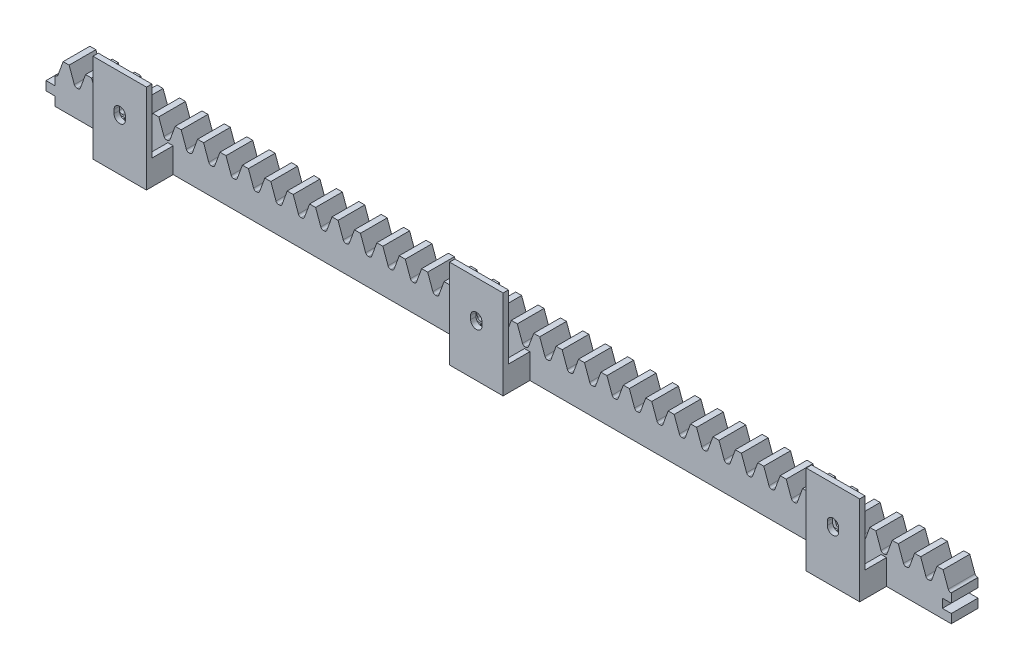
from build123d import *

# Parameters (mm, degrees)
SECTION_CREMAILLERE_W           = 15
SECTION_CREMAILLERE_H           = 27.14159266
BASE_EXTRUSION_DEPTH            = 502.6548256
ENL_V_START                     = -500.969718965
ENL_V_MAT_EXTRU_2_DEPTH         = 600.969718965
R_P_TITION_LIN_AIRE1_COUNT      = 40
R_P_TITION_LIN_AIRE1_PITCH      = 12.56637064
ESQUISSE4_W                     = 3
ESQUISSE4_H                     = 12
BOSS_EXTRU_1_DEPTH              = 14
ESQUISSE5_W                     = 30
ESQUISSE5_H                     = 50
BOSS_EXTRU_2_DEPTH              = 3
ENL_V_MAT_EXTRU_3_DEPTH         = 502.311749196
R_P_TITION_LIN_AIRE2_COUNT      = 2
R_P_TITION_LIN_AIRE2_PITCH      = 200
R_P_TITION_LIN_AIRE2_COUNT_DIR2 = 2
R_P_TITION_LIN_AIRE2_PITCH_DIR2 = 200
ESQUISSE8_W                     = 5
ESQUISSE8_H                     = 5
BOSS_EXTRU_3_DEPTH              = 15
ESQUISSE9_W                     = 5
ESQUISSE9_H                     = 5
ENL_V_MAT_EXTRU_4_DEPTH         = 502.311749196


with BuildPart() as part:
    # Section Cremaillere → Base-Extrusion (new body)
    with BuildSketch(Plane(origin=(-3.14159266, 0, 0), x_dir=(0, 0, -1), z_dir=(1, 0, 0))):
        with Locations((0, -6.42920367)):
            Rectangle(SECTION_CREMAILLERE_W, SECTION_CREMAILLERE_H)
    extrude(amount=BASE_EXTRUSION_DEPTH)

    # Esquisse1 → Enl_v. mat.-Extru.2 (cut)
    with BuildSketch(Plane.XY.offset(ENL_V_START)):
        with BuildLine():
            Line((1.455582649, 4), (-1.45550134, -3.99977656))
            ThreePointArc((-1.45550134, -3.99977656), (-2.011991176, -4.725082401), (-2.883868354, -5))
            Line((-2.883868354, -5), (-3.14159266, -5))
            Line((-3.14159266, -5), (-3.14159266, 7.14159266))
            Line((-3.14159266, 7.14159266), (9.42477798, 7.14159266))
            Line((9.42477798, 7.14159266), (9.42477798, -5))
            Line((9.42477798, -5), (9.167053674, -5))
            ThreePointArc((9.167053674, -5), (8.295176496, -4.725082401), (7.73868666, -3.99977656))
            Line((7.73868666, -3.99977656), (4.827602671, 4))
            Line((4.827602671, 4), (1.455582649, 4))
        make_face()
    enl_v_mat_extru_2 = extrude(amount=ENL_V_MAT_EXTRU_2_DEPTH, mode=Mode.SUBTRACT)

    # R_p_tition lin_aire1: Enl_v. mat.-Extru.2 ×40
    with Locations(*[(i * R_P_TITION_LIN_AIRE1_PITCH, 0, 0) for i in range(1, R_P_TITION_LIN_AIRE1_COUNT)]):
        add(enl_v_mat_extru_2, mode=Mode.SUBTRACT)

    # Esquisse4 → Boss.-Extru.1 (add)
    with BuildSketch(Plane.XZ.offset(20)):
        with Locations((234.68582014, 13.5)):
            Rectangle(ESQUISSE4_W, ESQUISSE4_H)
        with Locations((261.68582014, 13.5)):
            Rectangle(ESQUISSE4_W, ESQUISSE4_H)
    boss_extru_1 = extrude(amount=-BOSS_EXTRU_1_DEPTH)

    # Esquisse5 → Boss.-Extru.2 (add)
    with BuildSketch(Plane.XY.offset(19.5)):
        with Locations((248.18582014, 5)):
            Rectangle(ESQUISSE5_W, ESQUISSE5_H)
    boss_extru_2 = extrude(amount=BOSS_EXTRU_2_DEPTH)

    # Esquisse7 → Enl_v. mat.-Extru.3 (cut, through all)
    with BuildSketch(Plane.XY.offset(22.5)):
        with BuildLine():
            Line((244.98582014, 8), (244.98582014, 10))
            ThreePointArc((244.98582014, 10), (248.18582014, 13.2), (251.38582014, 10))
            Line((251.38582014, 10), (251.38582014, 8))
            ThreePointArc((251.38582014, 8), (248.18582014, 4.8), (244.98582014, 8))
        make_face()
    enl_v_mat_extru_3 = extrude(amount=-ENL_V_MAT_EXTRU_3_DEPTH, mode=Mode.SUBTRACT)

    # R_p_tition lin_aire2: Boss.-Extru.1, Boss.-Extru.2, Enl_v. mat.-Extru.3 2 × 2
    with Locations(*[Vector(1, 0, 0) * (i * R_P_TITION_LIN_AIRE2_PITCH) + Vector(-1, 0, 0) * (j * R_P_TITION_LIN_AIRE2_PITCH_DIR2) for i in range(R_P_TITION_LIN_AIRE2_COUNT) for j in range(R_P_TITION_LIN_AIRE2_COUNT_DIR2) if (i, j) != (0, 0)]):
        add(boss_extru_1)
        add(boss_extru_2)
        add(enl_v_mat_extru_3, mode=Mode.SUBTRACT)

    # Esquisse8 → Boss.-Extru.3 (add)
    with BuildSketch(Plane(origin=(0, 0, -7.5), x_dir=(-1, 0, 0), z_dir=(0, 0, -1))):
        with Locations((5.64159266, -12.5)):
            Rectangle(ESQUISSE8_W, ESQUISSE8_H)
    extrude(amount=-BOSS_EXTRU_3_DEPTH)

    # Esquisse9 → Enl_v. mat.-Extru.4 (cut, through all)
    with BuildSketch(Plane(origin=(0, 0, -7.5), x_dir=(-1, 0, 0), z_dir=(0, 0, -1))):
        with Locations((-497.01323294, -12.5)):
            Rectangle(ESQUISSE9_W, ESQUISSE9_H)
    extrude(amount=-ENL_V_MAT_EXTRU_4_DEPTH, mode=Mode.SUBTRACT)


solid = part.part
